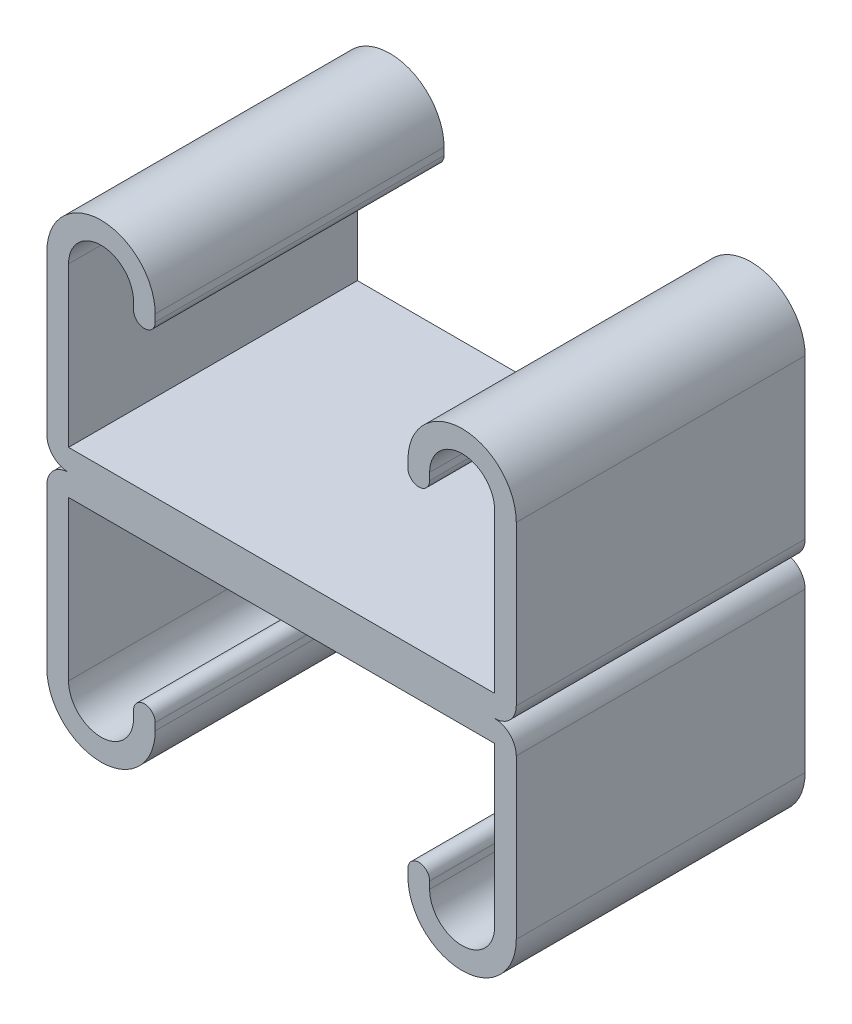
from build123d import *

# Parameters (mm, degrees)
BASE_EXTRUDE_DEPTH = 12.7


with BuildPart() as part:
    # Sketch1 → Base-Extrude (new, symmetric)
    with BuildSketch(Plane.XY):
        with BuildLine():
            Line((-20.6375, 15.875), (-20.6375, 1.905))
            ThreePointArc((-20.6375, 1.905), (-20.079538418, 0.557961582), (-18.7325, 0))
            Line((-18.7325, 0), (18.7325, 0))
            ThreePointArc((18.7325, 0), (20.079538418, 0.557961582), (20.6375, 1.905))
            Line((20.6375, 1.905), (20.6375, 15.875))
            ThreePointArc((20.6375, 15.875), (15.875, 20.6375), (11.1125, 15.875))
            Line((11.1125, 15.875), (11.1125, 15.24))
            ThreePointArc((11.1125, 15.24), (12.065, 14.2875), (13.0175, 15.24))
            Line((13.0175, 15.24), (13.0175, 15.875))
            ThreePointArc((13.0175, 15.875), (15.875, 18.7325), (18.7325, 15.875))
            Line((18.7325, 15.875), (18.7325, 1.905))
            Line((18.7325, 1.905), (-18.7325, 1.905))
            Line((-18.7325, 1.905), (-18.7325, 15.875))
            ThreePointArc((-18.7325, 15.875), (-15.875, 18.7325), (-13.0175, 15.875))
            Line((-13.0175, 15.875), (-13.0175, 15.24))
            ThreePointArc((-13.0175, 15.24), (-12.065, 14.2875), (-11.1125, 15.24))
            Line((-11.1125, 15.24), (-11.1125, 15.875))
            ThreePointArc((-11.1125, 15.875), (-15.875, 20.6375), (-20.6375, 15.875))
        make_face()
    base_extrude = extrude(amount=BASE_EXTRUDE_DEPTH, both=True)

    # Mirror1: Base-Extrude across plane
    add(base_extrude.mirror(Plane.ZX))


solid = part.part
